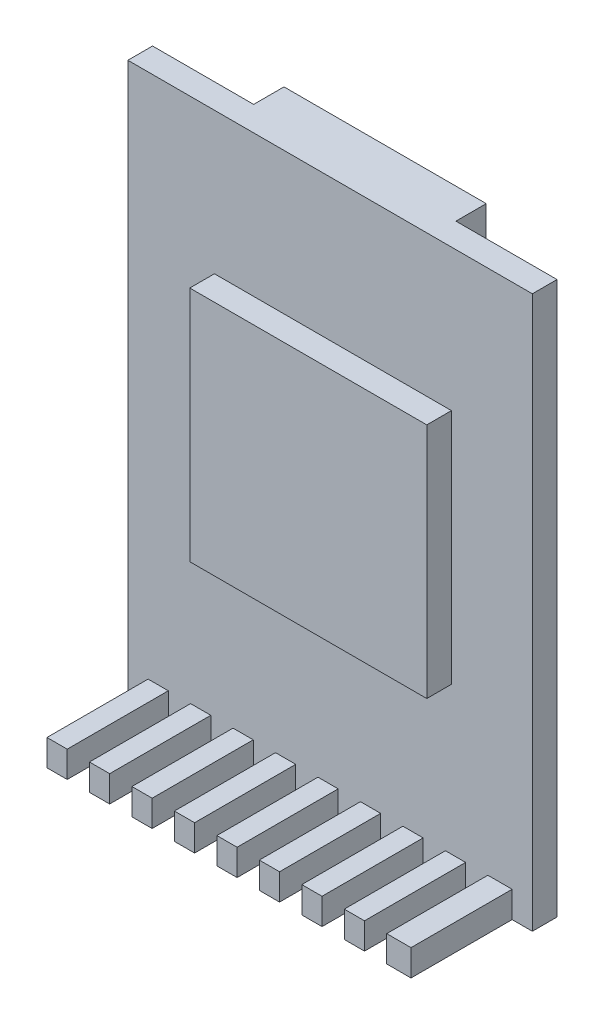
from build123d import *

# Parameters (mm, degrees)
SKETCH1_W           = 25.4
SKETCH1_H           = 34.671
BOSS_EXTRUDE1_DEPTH = 1.5494
SKETCH2_W           = 14.8844
SKETCH2_H           = 14.8844
BOSS_EXTRUDE2_DEPTH = 1.5494
SKETCH3_W           = 22.86
SKETCH3_H           = 1.651
BOSS_EXTRUDE3_DEPTH = 6.35
SKETCH4_W           = 1.397
SKETCH4_H           = 6.35
CUT_EXTRUDE1_DEPTH  = 6.35
BOSS_EXTRUDE4_DEPTH = 1.905


with BuildPart() as part:
    # Sketch1 → Boss-Extrude1 (new body)
    with BuildSketch(Plane.XY):
        with Locations((12.7, 17.3355)):
            Rectangle(SKETCH1_W, SKETCH1_H)
    extrude(amount=BOSS_EXTRUDE1_DEPTH)

    # Sketch2 → Boss-Extrude2 (add)
    with BuildSketch(Plane.XY.offset(1.5494)):
        with Locations((12.8778, 18.334748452)):
            Rectangle(SKETCH2_W, SKETCH2_H)
    extrude(amount=BOSS_EXTRUDE2_DEPTH)

    # Sketch3 → Boss-Extrude3 (add)
    with BuildSketch(Plane.XY.offset(1.5494)):
        with Locations((12.7, 0.8255)):
            Rectangle(SKETCH3_W, SKETCH3_H)
    extrude(amount=BOSS_EXTRUDE3_DEPTH)

    # Sketch4 → Cut-Extrude1 (cut)
    with BuildSketch(Plane(origin=(0, 1.651, 0), x_dir=(1, 0, 0), z_dir=(0, 1, 0))):
        with Locations((3.2385, -4.7244)):
            Rectangle(SKETCH4_W, SKETCH4_H)
        with Locations((5.9055, -4.7244)):
            Rectangle(SKETCH4_W, SKETCH4_H)
        with Locations((8.5725, -4.7244)):
            Rectangle(SKETCH4_W, SKETCH4_H)
        with Locations((11.2395, -4.7244)):
            Rectangle(SKETCH4_W, SKETCH4_H)
        with Locations((13.9065, -4.7244)):
            Rectangle(SKETCH4_W, SKETCH4_H)
        with Locations((16.5735, -4.7244)):
            Rectangle(SKETCH4_W, SKETCH4_H)
        with Locations((19.2405, -4.7244)):
            Rectangle(SKETCH4_W, SKETCH4_H)
        with Locations((21.9075, -4.7244)):
            Rectangle(SKETCH4_W, SKETCH4_H)
    extrude(amount=-CUT_EXTRUDE1_DEPTH, mode=Mode.SUBTRACT)

    # Sketch5 → Boss-Extrude4 (add)
    with BuildSketch(Plane(origin=(0, 0, 0), x_dir=(-1, 0, 0), z_dir=(0, 0, -1))):
        with BuildLine():
            Line((-19.05, 27.511679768), (-19.05, 34.671))
            Line((-19.05, 34.671), (-6.35, 34.671))
            Line((-6.35, 34.671), (-6.35, 27.511679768))
            ThreePointArc((-6.35, 27.511679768), (-12.7, 21.161679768), (-19.05, 27.511679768))
        make_face()
    extrude(amount=BOSS_EXTRUDE4_DEPTH)


solid = part.part
